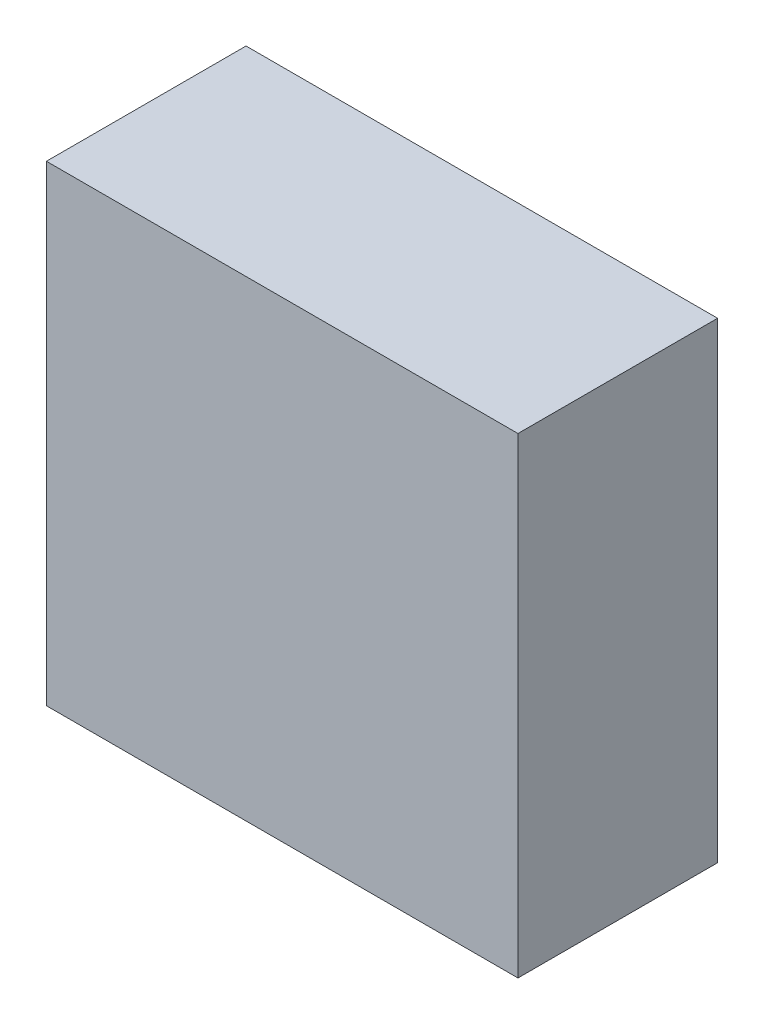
from build123d import *

# Parameters (mm, degrees)
SKETCH1_W           = 120
SKETCH1_H           = 120
BOSS_EXTRUDE1_DEPTH = 50.8


with BuildPart() as part:
    # Sketch1 → Boss-Extrude1 (new body)
    with BuildSketch(Plane.XY):
        with Locations((60, 60)):
            Rectangle(SKETCH1_W, SKETCH1_H)
    extrude(amount=BOSS_EXTRUDE1_DEPTH)


solid = part.part
